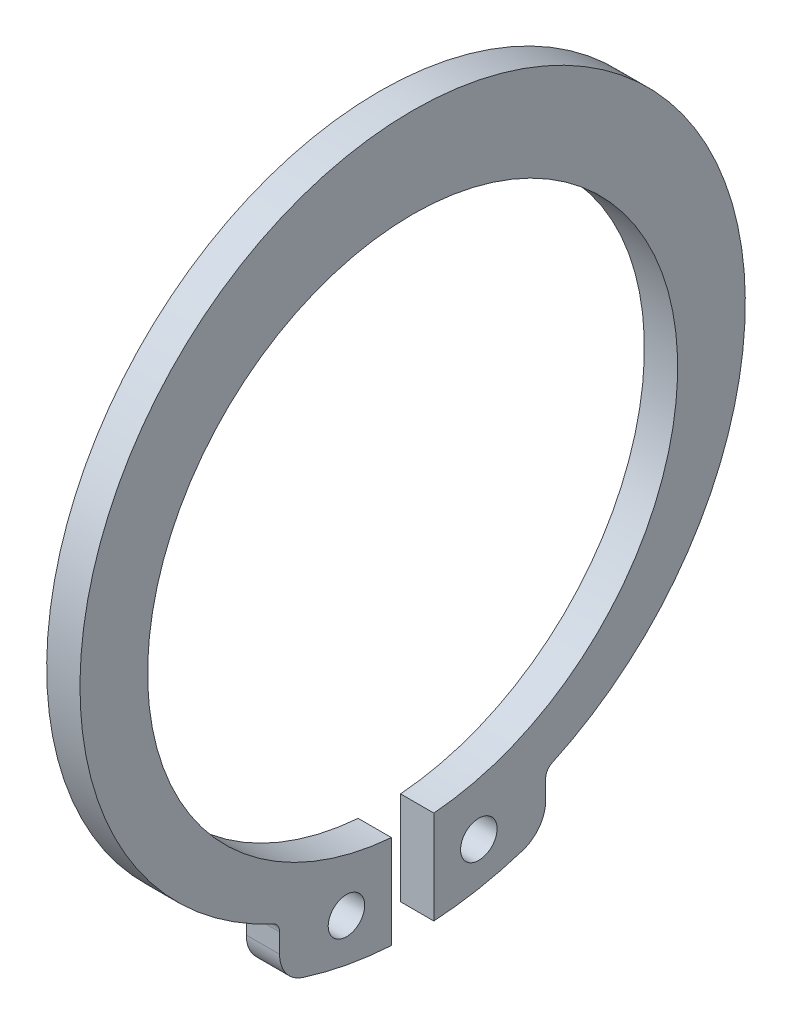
ISO-10303-21;
HEADER;
FILE_DESCRIPTION(('STEP AP214'),'2;1');
FILE_NAME('part.step','',(''),(''),'','','');
FILE_SCHEMA(('AUTOMOTIVE_DESIGN { 1 0 10303 214 1 1 1 1 }'));
ENDSEC;
DATA;
#1=APPLICATION_CONTEXT('core data for automotive mechanical design processes');
#2=APPLICATION_PROTOCOL_DEFINITION('international standard','automotive_design',2000,#1);
#3=PRODUCT_CONTEXT('',#1,'mechanical');
#4=PRODUCT('Part','Part','',(#3));
#5=PRODUCT_RELATED_PRODUCT_CATEGORY('part','',(#4));
#6=PRODUCT_DEFINITION_FORMATION('','',#4);
#7=PRODUCT_DEFINITION_CONTEXT('part definition',#1,'design');
#8=PRODUCT_DEFINITION('design','',#6,#7);
#9=PRODUCT_DEFINITION_SHAPE('','',#8);
#10=(LENGTH_UNIT() NAMED_UNIT(*) SI_UNIT(.MILLI.,.METRE.));
#11=(NAMED_UNIT(*) PLANE_ANGLE_UNIT() SI_UNIT($,.RADIAN.));
#12=(NAMED_UNIT(*) SI_UNIT($,.STERADIAN.) SOLID_ANGLE_UNIT());
#13=UNCERTAINTY_MEASURE_WITH_UNIT(LENGTH_MEASURE(1.E-05),#10,'distance_accuracy_value','');
#14=(GEOMETRIC_REPRESENTATION_CONTEXT(3) GLOBAL_UNCERTAINTY_ASSIGNED_CONTEXT((#13)) GLOBAL_UNIT_ASSIGNED_CONTEXT((#10,
#11,#12)) REPRESENTATION_CONTEXT('',''));
#15=CARTESIAN_POINT('',(0.,0.,0.));
#16=DIRECTION('',(0.,0.,1.));
#17=DIRECTION('',(1.,0.,0.));
#18=AXIS2_PLACEMENT_3D('',#15,#16,#17);
#19=CARTESIAN_POINT('',(1.5,-13.9475272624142,-4.49999999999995));
#20=DIRECTION('',(-1.,0.,0.));
#21=DIRECTION('',(0.,0.,1.));
#22=AXIS2_PLACEMENT_3D('',#19,#20,#21);
#23=PLANE('',#22);
#24=CARTESIAN_POINT('',(1.5,-13.9475272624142,-2.9838971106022));
#25=DIRECTION('',(1.,0.,0.));
#26=DIRECTION('',(0.,0.,-1.));
#27=AXIS2_PLACEMENT_3D('',#24,#25,#26);
#28=CIRCLE('',#27,0.823144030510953);
#29=CARTESIAN_POINT('',(1.5,-13.9475272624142,-3.80704114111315));
#30=VERTEX_POINT('',#29);
#31=EDGE_CURVE('E137',#30,#30,#28,.T.);
#32=ORIENTED_EDGE('',*,*,#31,.F.);
#33=EDGE_LOOP('',(#32));
#34=FACE_BOUND('',#33,.T.);
#35=CARTESIAN_POINT('',(1.5,-13.9475272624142,-4.49999999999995));
#36=DIRECTION('',(1.,0.,0.));
#37=DIRECTION('',(0.,0.,1.));
#38=AXIS2_PLACEMENT_3D('',#35,#36,#37);
#39=CIRCLE('',#38,1.5);
#40=CARTESIAN_POINT('',(1.5,-15.3750663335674,-4.96057811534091));
#41=VERTEX_POINT('',#40);
#42=CARTESIAN_POINT('',(1.5,-13.9475272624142,-5.99999999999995));
#43=VERTEX_POINT('',#42);
#44=EDGE_CURVE('E163',#41,#43,#39,.T.);
#45=ORIENTED_EDGE('',*,*,#44,.T.);
#46=DIRECTION('',(0.,1.,0.));
#47=VECTOR('',#46,1.);
#48=CARTESIAN_POINT('',(1.5,-13.0712472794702,-5.99999999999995));
#49=LINE('',#48,#47);
#50=CARTESIAN_POINT('',(1.5,-13.0712472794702,-5.99999999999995));
#51=VERTEX_POINT('',#50);
#52=EDGE_CURVE('E132',#43,#51,#49,.T.);
#53=ORIENTED_EDGE('',*,*,#52,.T.);
#54=CARTESIAN_POINT('',(1.5,-13.0712472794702,-6.49999999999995));
#55=DIRECTION('',(-1.,0.,0.));
#56=DIRECTION('',(0.,0.,1.));
#57=AXIS2_PLACEMENT_3D('',#54,#55,#56);
#58=CIRCLE('',#57,0.499999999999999);
#59=CARTESIAN_POINT('',(1.5,-12.6173360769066,-6.29032258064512));
#60=VERTEX_POINT('',#59);
#61=EDGE_CURVE('E166',#51,#60,#58,.T.);
#62=ORIENTED_EDGE('',*,*,#61,.T.);
#63=CARTESIAN_POINT('',(1.5,0.999999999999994,0.));
#64=DIRECTION('',(1.,0.,0.));
#65=DIRECTION('',(0.,0.,-1.));
#66=AXIS2_PLACEMENT_3D('',#63,#64,#65);
#67=CIRCLE('',#66,14.9999999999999);
#68=CARTESIAN_POINT('',(1.5,-12.6173360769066,6.29032258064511));
#69=VERTEX_POINT('',#68);
#70=EDGE_CURVE('E168',#60,#69,#67,.T.);
#71=ORIENTED_EDGE('',*,*,#70,.T.);
#72=CARTESIAN_POINT('',(1.5,-13.0712472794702,6.49999999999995));
#73=DIRECTION('',(-1.,0.,0.));
#74=DIRECTION('',(0.,0.,-1.));
#75=AXIS2_PLACEMENT_3D('',#72,#73,#74);
#76=CIRCLE('',#75,0.499999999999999);
#77=CARTESIAN_POINT('',(1.5,-13.0712472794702,5.99999999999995));
#78=VERTEX_POINT('',#77);
#79=EDGE_CURVE('E170',#69,#78,#76,.T.);
#80=ORIENTED_EDGE('',*,*,#79,.T.);
#81=DIRECTION('',(0.,-1.,0.));
#82=VECTOR('',#81,1.);
#83=CARTESIAN_POINT('',(1.5,-13.0712472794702,5.99999999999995));
#84=LINE('',#83,#82);
#85=CARTESIAN_POINT('',(1.5,-13.9475272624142,5.99999999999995));
#86=VERTEX_POINT('',#85);
#87=EDGE_CURVE('E172',#78,#86,#84,.T.);
#88=ORIENTED_EDGE('',*,*,#87,.T.);
#89=CARTESIAN_POINT('',(1.5,-13.9475272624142,4.49999999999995));
#90=DIRECTION('',(1.,0.,0.));
#91=DIRECTION('',(0.,0.,-1.));
#92=AXIS2_PLACEMENT_3D('',#89,#90,#91);
#93=CIRCLE('',#92,1.5);
#94=CARTESIAN_POINT('',(1.5,-15.3750663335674,4.96057811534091));
#95=VERTEX_POINT('',#94);
#96=EDGE_CURVE('E174',#86,#95,#93,.T.);
#97=ORIENTED_EDGE('',*,*,#96,.T.);
#98=CARTESIAN_POINT('',(1.5,0.,0.));
#99=DIRECTION('',(1.,0.,0.));
#100=DIRECTION('',(0.,0.,1.));
#101=AXIS2_PLACEMENT_3D('',#98,#99,#100);
#102=CIRCLE('',#101,16.1554944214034);
#103=CARTESIAN_POINT('',(1.5,-16.1271840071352,0.955999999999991));
#104=VERTEX_POINT('',#103);
#105=EDGE_CURVE('E176',#95,#104,#102,.T.);
#106=ORIENTED_EDGE('',*,*,#105,.T.);
#107=DIRECTION('',(0.,1.,0.));
#108=VECTOR('',#107,1.);
#109=CARTESIAN_POINT('',(1.5,-11.9116986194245,0.955999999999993));
#110=LINE('',#109,#108);
#111=CARTESIAN_POINT('',(1.5,-11.9116986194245,0.955999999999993));
#112=VERTEX_POINT('',#111);
#113=EDGE_CURVE('E178',#104,#112,#110,.T.);
#114=ORIENTED_EDGE('',*,*,#113,.T.);
#115=CARTESIAN_POINT('',(1.5,0.,0.));
#116=DIRECTION('',(-1.,0.,0.));
#117=DIRECTION('',(0.,0.,-1.));
#118=AXIS2_PLACEMENT_3D('',#115,#116,#117);
#119=CIRCLE('',#118,11.95);
#120=CARTESIAN_POINT('',(1.5,-11.9116986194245,-0.955999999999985));
#121=VERTEX_POINT('',#120);
#122=EDGE_CURVE('E180',#112,#121,#119,.T.);
#123=ORIENTED_EDGE('',*,*,#122,.T.);
#124=DIRECTION('',(0.,-1.,0.));
#125=VECTOR('',#124,1.);
#126=CARTESIAN_POINT('',(1.5,-11.9116986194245,-0.955999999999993));
#127=LINE('',#126,#125);
#128=CARTESIAN_POINT('',(1.5,-16.1271840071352,-0.955999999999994));
#129=VERTEX_POINT('',#128);
#130=EDGE_CURVE('E49',#121,#129,#127,.T.);
#131=ORIENTED_EDGE('',*,*,#130,.T.);
#132=CARTESIAN_POINT('',(1.5,0.,0.));
#133=DIRECTION('',(1.,0.,0.));
#134=DIRECTION('',(0.,0.,-1.));
#135=AXIS2_PLACEMENT_3D('',#132,#133,#134);
#136=CIRCLE('',#135,16.1554944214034);
#137=EDGE_CURVE('E44',#129,#41,#136,.T.);
#138=ORIENTED_EDGE('',*,*,#137,.T.);
#139=EDGE_LOOP('',(#45,#53,#62,#71,#80,#88,#97,#106,#114,#123,#131,#138));
#140=FACE_BOUND('',#139,.T.);
#141=CARTESIAN_POINT('',(1.5,-13.9475272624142,2.9838971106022));
#142=DIRECTION('',(1.,0.,0.));
#143=DIRECTION('',(0.,0.,1.));
#144=AXIS2_PLACEMENT_3D('',#141,#142,#143);
#145=CIRCLE('',#144,0.823144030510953);
#146=CARTESIAN_POINT('',(1.5,-13.9475272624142,3.80704114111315));
#147=VERTEX_POINT('',#146);
#148=EDGE_CURVE('E283',#147,#147,#145,.T.);
#149=ORIENTED_EDGE('',*,*,#148,.F.);
#150=EDGE_LOOP('',(#149));
#151=FACE_BOUND('',#150,.T.);
#152=ADVANCED_FACE('F29',(#34,#140,#151),#23,.F.);
#153=CARTESIAN_POINT('',(0.,-13.9475272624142,-4.49999999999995));
#154=DIRECTION('',(-1.,0.,0.));
#155=DIRECTION('',(0.,0.,1.));
#156=AXIS2_PLACEMENT_3D('',#153,#154,#155);
#157=PLANE('',#156);
#158=CARTESIAN_POINT('',(0.,-13.9475272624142,-2.9838971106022));
#159=DIRECTION('',(1.,0.,0.));
#160=DIRECTION('',(0.,0.,-1.));
#161=AXIS2_PLACEMENT_3D('',#158,#159,#160);
#162=CIRCLE('',#161,0.823144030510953);
#163=CARTESIAN_POINT('',(0.,-13.9475272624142,-3.80704114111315));
#164=VERTEX_POINT('',#163);
#165=EDGE_CURVE('E140',#164,#164,#162,.T.);
#166=ORIENTED_EDGE('',*,*,#165,.T.);
#167=EDGE_LOOP('',(#166));
#168=FACE_BOUND('',#167,.T.);
#169=CARTESIAN_POINT('',(0.,-13.9475272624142,-4.49999999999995));
#170=DIRECTION('',(1.,0.,0.));
#171=DIRECTION('',(0.,0.,1.));
#172=AXIS2_PLACEMENT_3D('',#169,#170,#171);
#173=CIRCLE('',#172,1.5);
#174=CARTESIAN_POINT('',(0.,-15.3750663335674,-4.96057811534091));
#175=VERTEX_POINT('',#174);
#176=CARTESIAN_POINT('',(0.,-13.9475272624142,-5.99999999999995));
#177=VERTEX_POINT('',#176);
#178=EDGE_CURVE('E123',#175,#177,#173,.T.);
#179=ORIENTED_EDGE('',*,*,#178,.F.);
#180=CARTESIAN_POINT('',(0.,0.,0.));
#181=DIRECTION('',(1.,0.,0.));
#182=DIRECTION('',(0.,0.,-1.));
#183=AXIS2_PLACEMENT_3D('',#180,#181,#182);
#184=CIRCLE('',#183,16.1554944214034);
#185=CARTESIAN_POINT('',(0.,-16.1271840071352,-0.955999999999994));
#186=VERTEX_POINT('',#185);
#187=EDGE_CURVE('E161',#186,#175,#184,.T.);
#188=ORIENTED_EDGE('',*,*,#187,.F.);
#189=DIRECTION('',(0.,-1.,0.));
#190=VECTOR('',#189,1.);
#191=CARTESIAN_POINT('',(0.,-11.9116986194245,-0.955999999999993));
#192=LINE('',#191,#190);
#193=CARTESIAN_POINT('',(0.,-11.9116986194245,-0.955999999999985));
#194=VERTEX_POINT('',#193);
#195=EDGE_CURVE('E159',#194,#186,#192,.T.);
#196=ORIENTED_EDGE('',*,*,#195,.F.);
#197=CARTESIAN_POINT('',(0.,0.,0.));
#198=DIRECTION('',(-1.,0.,0.));
#199=DIRECTION('',(0.,0.,-1.));
#200=AXIS2_PLACEMENT_3D('',#197,#198,#199);
#201=CIRCLE('',#200,11.95);
#202=CARTESIAN_POINT('',(0.,-11.9116986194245,0.955999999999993));
#203=VERTEX_POINT('',#202);
#204=EDGE_CURVE('E157',#203,#194,#201,.T.);
#205=ORIENTED_EDGE('',*,*,#204,.F.);
#206=DIRECTION('',(0.,1.,0.));
#207=VECTOR('',#206,1.);
#208=CARTESIAN_POINT('',(0.,-11.9116986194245,0.955999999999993));
#209=LINE('',#208,#207);
#210=CARTESIAN_POINT('',(0.,-16.1271840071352,0.955999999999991));
#211=VERTEX_POINT('',#210);
#212=EDGE_CURVE('E155',#211,#203,#209,.T.);
#213=ORIENTED_EDGE('',*,*,#212,.F.);
#214=CARTESIAN_POINT('',(0.,0.,0.));
#215=DIRECTION('',(1.,0.,0.));
#216=DIRECTION('',(0.,0.,1.));
#217=AXIS2_PLACEMENT_3D('',#214,#215,#216);
#218=CIRCLE('',#217,16.1554944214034);
#219=CARTESIAN_POINT('',(0.,-15.3750663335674,4.96057811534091));
#220=VERTEX_POINT('',#219);
#221=EDGE_CURVE('E153',#220,#211,#218,.T.);
#222=ORIENTED_EDGE('',*,*,#221,.F.);
#223=CARTESIAN_POINT('',(0.,-13.9475272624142,4.49999999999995));
#224=DIRECTION('',(1.,0.,0.));
#225=DIRECTION('',(0.,0.,-1.));
#226=AXIS2_PLACEMENT_3D('',#223,#224,#225);
#227=CIRCLE('',#226,1.5);
#228=CARTESIAN_POINT('',(0.,-13.9475272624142,5.99999999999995));
#229=VERTEX_POINT('',#228);
#230=EDGE_CURVE('E151',#229,#220,#227,.T.);
#231=ORIENTED_EDGE('',*,*,#230,.F.);
#232=DIRECTION('',(0.,-1.,0.));
#233=VECTOR('',#232,1.);
#234=CARTESIAN_POINT('',(0.,-13.0712472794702,5.99999999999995));
#235=LINE('',#234,#233);
#236=CARTESIAN_POINT('',(0.,-13.0712472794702,5.99999999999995));
#237=VERTEX_POINT('',#236);
#238=EDGE_CURVE('E149',#237,#229,#235,.T.);
#239=ORIENTED_EDGE('',*,*,#238,.F.);
#240=CARTESIAN_POINT('',(0.,-13.0712472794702,6.49999999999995));
#241=DIRECTION('',(-1.,0.,0.));
#242=DIRECTION('',(0.,0.,-1.));
#243=AXIS2_PLACEMENT_3D('',#240,#241,#242);
#244=CIRCLE('',#243,0.499999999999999);
#245=CARTESIAN_POINT('',(0.,-12.6173360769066,6.29032258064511));
#246=VERTEX_POINT('',#245);
#247=EDGE_CURVE('E147',#246,#237,#244,.T.);
#248=ORIENTED_EDGE('',*,*,#247,.F.);
#249=CARTESIAN_POINT('',(0.,0.999999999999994,0.));
#250=DIRECTION('',(1.,0.,0.));
#251=DIRECTION('',(0.,0.,-1.));
#252=AXIS2_PLACEMENT_3D('',#249,#250,#251);
#253=CIRCLE('',#252,14.9999999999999);
#254=CARTESIAN_POINT('',(0.,-12.6173360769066,-6.29032258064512));
#255=VERTEX_POINT('',#254);
#256=EDGE_CURVE('E145',#255,#246,#253,.T.);
#257=ORIENTED_EDGE('',*,*,#256,.F.);
#258=CARTESIAN_POINT('',(0.,-13.0712472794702,-6.49999999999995));
#259=DIRECTION('',(-1.,0.,0.));
#260=DIRECTION('',(0.,0.,1.));
#261=AXIS2_PLACEMENT_3D('',#258,#259,#260);
#262=CIRCLE('',#261,0.499999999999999);
#263=CARTESIAN_POINT('',(0.,-13.0712472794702,-5.99999999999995));
#264=VERTEX_POINT('',#263);
#265=EDGE_CURVE('E125',#264,#255,#262,.T.);
#266=ORIENTED_EDGE('',*,*,#265,.F.);
#267=DIRECTION('',(0.,1.,0.));
#268=VECTOR('',#267,1.);
#269=CARTESIAN_POINT('',(0.,-13.0712472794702,-5.99999999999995));
#270=LINE('',#269,#268);
#271=EDGE_CURVE('E118',#177,#264,#270,.T.);
#272=ORIENTED_EDGE('',*,*,#271,.F.);
#273=EDGE_LOOP('',(#179,#188,#196,#205,#213,#222,#231,#239,#248,#257,#266,#272));
#274=FACE_BOUND('',#273,.T.);
#275=CARTESIAN_POINT('',(0.,-13.9475272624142,2.9838971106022));
#276=DIRECTION('',(1.,0.,0.));
#277=DIRECTION('',(0.,0.,1.));
#278=AXIS2_PLACEMENT_3D('',#275,#276,#277);
#279=CIRCLE('',#278,0.823144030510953);
#280=CARTESIAN_POINT('',(0.,-13.9475272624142,3.80704114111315));
#281=VERTEX_POINT('',#280);
#282=EDGE_CURVE('E286',#281,#281,#279,.T.);
#283=ORIENTED_EDGE('',*,*,#282,.T.);
#284=EDGE_LOOP('',(#283));
#285=FACE_BOUND('',#284,.T.);
#286=ADVANCED_FACE('F119',(#168,#274,#285),#157,.T.);
#287=CARTESIAN_POINT('',(1.5,-13.9475272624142,-4.49999999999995));
#288=DIRECTION('',(-1.,0.,0.));
#289=DIRECTION('',(0.,0.,1.));
#290=AXIS2_PLACEMENT_3D('',#287,#288,#289);
#291=CYLINDRICAL_SURFACE('',#290,1.5);
#292=ORIENTED_EDGE('',*,*,#178,.T.);
#293=DIRECTION('',(-1.,0.,0.));
#294=VECTOR('',#293,1.);
#295=CARTESIAN_POINT('',(1.5,-13.9475272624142,-5.99999999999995));
#296=LINE('',#295,#294);
#297=EDGE_CURVE('E11',#43,#177,#296,.T.);
#298=ORIENTED_EDGE('',*,*,#297,.F.);
#299=ORIENTED_EDGE('',*,*,#44,.F.);
#300=DIRECTION('',(-1.,0.,0.));
#301=VECTOR('',#300,1.);
#302=CARTESIAN_POINT('',(1.5,-15.3750663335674,-4.96057811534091));
#303=LINE('',#302,#301);
#304=EDGE_CURVE('E136',#41,#175,#303,.T.);
#305=ORIENTED_EDGE('',*,*,#304,.T.);
#306=EDGE_LOOP('',(#292,#298,#299,#305));
#307=FACE_BOUND('',#306,.T.);
#308=ADVANCED_FACE('F31',(#307),#291,.T.);
#309=CARTESIAN_POINT('',(1.5,-13.0712472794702,-5.99999999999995));
#310=DIRECTION('',(0.,0.,1.));
#311=DIRECTION('',(1.,0.,0.));
#312=AXIS2_PLACEMENT_3D('',#309,#310,#311);
#313=PLANE('',#312);
#314=ORIENTED_EDGE('',*,*,#271,.T.);
#315=DIRECTION('',(-1.,0.,0.));
#316=VECTOR('',#315,1.);
#317=CARTESIAN_POINT('',(1.5,-13.0712472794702,-5.99999999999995));
#318=LINE('',#317,#316);
#319=EDGE_CURVE('E37',#51,#264,#318,.T.);
#320=ORIENTED_EDGE('',*,*,#319,.F.);
#321=ORIENTED_EDGE('',*,*,#52,.F.);
#322=ORIENTED_EDGE('',*,*,#297,.T.);
#323=EDGE_LOOP('',(#314,#320,#321,#322));
#324=FACE_BOUND('',#323,.T.);
#325=ADVANCED_FACE('F131',(#324),#313,.F.);
#326=CARTESIAN_POINT('',(1.5,-13.0712472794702,-6.49999999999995));
#327=DIRECTION('',(-1.,0.,0.));
#328=DIRECTION('',(0.,0.,1.));
#329=AXIS2_PLACEMENT_3D('',#326,#327,#328);
#330=CYLINDRICAL_SURFACE('',#329,0.499999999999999);
#331=ORIENTED_EDGE('',*,*,#265,.T.);
#332=DIRECTION('',(-1.,0.,0.));
#333=VECTOR('',#332,1.);
#334=CARTESIAN_POINT('',(1.5,-12.6173360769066,-6.29032258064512));
#335=LINE('',#334,#333);
#336=EDGE_CURVE('E209',#60,#255,#335,.T.);
#337=ORIENTED_EDGE('',*,*,#336,.F.);
#338=ORIENTED_EDGE('',*,*,#61,.F.);
#339=ORIENTED_EDGE('',*,*,#319,.T.);
#340=EDGE_LOOP('',(#331,#337,#338,#339));
#341=FACE_BOUND('',#340,.T.);
#342=ADVANCED_FACE('F213',(#341),#330,.F.);
#343=CARTESIAN_POINT('',(1.5,0.999999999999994,0.));
#344=DIRECTION('',(-1.,0.,0.));
#345=DIRECTION('',(0.,0.,1.));
#346=AXIS2_PLACEMENT_3D('',#343,#344,#345);
#347=CYLINDRICAL_SURFACE('',#346,14.9999999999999);
#348=ORIENTED_EDGE('',*,*,#256,.T.);
#349=DIRECTION('',(-1.,0.,0.));
#350=VECTOR('',#349,1.);
#351=CARTESIAN_POINT('',(1.5,-12.6173360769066,6.29032258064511));
#352=LINE('',#351,#350);
#353=EDGE_CURVE('E206',#69,#246,#352,.T.);
#354=ORIENTED_EDGE('',*,*,#353,.F.);
#355=ORIENTED_EDGE('',*,*,#70,.F.);
#356=ORIENTED_EDGE('',*,*,#336,.T.);
#357=EDGE_LOOP('',(#348,#354,#355,#356));
#358=FACE_BOUND('',#357,.T.);
#359=ADVANCED_FACE('F221',(#358),#347,.T.);
#360=CARTESIAN_POINT('',(1.5,-13.0712472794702,6.49999999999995));
#361=DIRECTION('',(-1.,0.,0.));
#362=DIRECTION('',(0.,0.,1.));
#363=AXIS2_PLACEMENT_3D('',#360,#361,#362);
#364=CYLINDRICAL_SURFACE('',#363,0.499999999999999);
#365=ORIENTED_EDGE('',*,*,#247,.T.);
#366=DIRECTION('',(-1.,0.,0.));
#367=VECTOR('',#366,1.);
#368=CARTESIAN_POINT('',(1.5,-13.0712472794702,5.99999999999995));
#369=LINE('',#368,#367);
#370=EDGE_CURVE('E203',#78,#237,#369,.T.);
#371=ORIENTED_EDGE('',*,*,#370,.F.);
#372=ORIENTED_EDGE('',*,*,#79,.F.);
#373=ORIENTED_EDGE('',*,*,#353,.T.);
#374=EDGE_LOOP('',(#365,#371,#372,#373));
#375=FACE_BOUND('',#374,.T.);
#376=ADVANCED_FACE('F224',(#375),#364,.F.);
#377=CARTESIAN_POINT('',(1.5,-13.0712472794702,5.99999999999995));
#378=DIRECTION('',(0.,0.,-1.));
#379=DIRECTION('',(-1.,0.,0.));
#380=AXIS2_PLACEMENT_3D('',#377,#378,#379);
#381=PLANE('',#380);
#382=ORIENTED_EDGE('',*,*,#238,.T.);
#383=DIRECTION('',(-1.,0.,0.));
#384=VECTOR('',#383,1.);
#385=CARTESIAN_POINT('',(1.5,-13.9475272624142,5.99999999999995));
#386=LINE('',#385,#384);
#387=EDGE_CURVE('E200',#86,#229,#386,.T.);
#388=ORIENTED_EDGE('',*,*,#387,.F.);
#389=ORIENTED_EDGE('',*,*,#87,.F.);
#390=ORIENTED_EDGE('',*,*,#370,.T.);
#391=EDGE_LOOP('',(#382,#388,#389,#390));
#392=FACE_BOUND('',#391,.T.);
#393=ADVANCED_FACE('F229',(#392),#381,.F.);
#394=CARTESIAN_POINT('',(1.5,-13.9475272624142,4.49999999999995));
#395=DIRECTION('',(-1.,0.,0.));
#396=DIRECTION('',(0.,0.,1.));
#397=AXIS2_PLACEMENT_3D('',#394,#395,#396);
#398=CYLINDRICAL_SURFACE('',#397,1.5);
#399=ORIENTED_EDGE('',*,*,#230,.T.);
#400=DIRECTION('',(-1.,0.,0.));
#401=VECTOR('',#400,1.);
#402=CARTESIAN_POINT('',(1.5,-15.3750663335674,4.96057811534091));
#403=LINE('',#402,#401);
#404=EDGE_CURVE('E197',#95,#220,#403,.T.);
#405=ORIENTED_EDGE('',*,*,#404,.F.);
#406=ORIENTED_EDGE('',*,*,#96,.F.);
#407=ORIENTED_EDGE('',*,*,#387,.T.);
#408=EDGE_LOOP('',(#399,#405,#406,#407));
#409=FACE_BOUND('',#408,.T.);
#410=ADVANCED_FACE('F235',(#409),#398,.T.);
#411=CARTESIAN_POINT('',(1.5,0.,0.));
#412=DIRECTION('',(-1.,0.,0.));
#413=DIRECTION('',(0.,0.,1.));
#414=AXIS2_PLACEMENT_3D('',#411,#412,#413);
#415=CYLINDRICAL_SURFACE('',#414,16.1554944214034);
#416=ORIENTED_EDGE('',*,*,#221,.T.);
#417=DIRECTION('',(-1.,0.,0.));
#418=VECTOR('',#417,1.);
#419=CARTESIAN_POINT('',(1.5,-16.1271840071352,0.955999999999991));
#420=LINE('',#419,#418);
#421=EDGE_CURVE('E194',#104,#211,#420,.T.);
#422=ORIENTED_EDGE('',*,*,#421,.F.);
#423=ORIENTED_EDGE('',*,*,#105,.F.);
#424=ORIENTED_EDGE('',*,*,#404,.T.);
#425=EDGE_LOOP('',(#416,#422,#423,#424));
#426=FACE_BOUND('',#425,.T.);
#427=ADVANCED_FACE('F239',(#426),#415,.T.);
#428=CARTESIAN_POINT('',(1.5,-11.9116986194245,0.955999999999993));
#429=DIRECTION('',(0.,0.,1.));
#430=DIRECTION('',(0.,-1.,0.));
#431=AXIS2_PLACEMENT_3D('',#428,#429,#430);
#432=PLANE('',#431);
#433=ORIENTED_EDGE('',*,*,#212,.T.);
#434=DIRECTION('',(-1.,0.,0.));
#435=VECTOR('',#434,1.);
#436=CARTESIAN_POINT('',(1.5,-11.9116986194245,0.955999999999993));
#437=LINE('',#436,#435);
#438=EDGE_CURVE('E191',#112,#203,#437,.T.);
#439=ORIENTED_EDGE('',*,*,#438,.F.);
#440=ORIENTED_EDGE('',*,*,#113,.F.);
#441=ORIENTED_EDGE('',*,*,#421,.T.);
#442=EDGE_LOOP('',(#433,#439,#440,#441));
#443=FACE_BOUND('',#442,.T.);
#444=ADVANCED_FACE('F244',(#443),#432,.F.);
#445=CARTESIAN_POINT('',(1.5,0.,0.));
#446=DIRECTION('',(-1.,0.,0.));
#447=DIRECTION('',(0.,0.,1.));
#448=AXIS2_PLACEMENT_3D('',#445,#446,#447);
#449=CYLINDRICAL_SURFACE('',#448,11.95);
#450=ORIENTED_EDGE('',*,*,#204,.T.);
#451=DIRECTION('',(-1.,0.,0.));
#452=VECTOR('',#451,1.);
#453=CARTESIAN_POINT('',(1.5,-11.9116986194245,-0.955999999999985));
#454=LINE('',#453,#452);
#455=EDGE_CURVE('E188',#121,#194,#454,.T.);
#456=ORIENTED_EDGE('',*,*,#455,.F.);
#457=ORIENTED_EDGE('',*,*,#122,.F.);
#458=ORIENTED_EDGE('',*,*,#438,.T.);
#459=EDGE_LOOP('',(#450,#456,#457,#458));
#460=FACE_BOUND('',#459,.T.);
#461=ADVANCED_FACE('F248',(#460),#449,.F.);
#462=CARTESIAN_POINT('',(1.5,-11.9116986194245,-0.955999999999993));
#463=DIRECTION('',(0.,0.,-1.));
#464=DIRECTION('',(0.,1.,0.));
#465=AXIS2_PLACEMENT_3D('',#462,#463,#464);
#466=PLANE('',#465);
#467=ORIENTED_EDGE('',*,*,#195,.T.);
#468=DIRECTION('',(-1.,0.,0.));
#469=VECTOR('',#468,1.);
#470=CARTESIAN_POINT('',(1.5,-16.1271840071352,-0.955999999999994));
#471=LINE('',#470,#469);
#472=EDGE_CURVE('E185',#129,#186,#471,.T.);
#473=ORIENTED_EDGE('',*,*,#472,.F.);
#474=ORIENTED_EDGE('',*,*,#130,.F.);
#475=ORIENTED_EDGE('',*,*,#455,.T.);
#476=EDGE_LOOP('',(#467,#473,#474,#475));
#477=FACE_BOUND('',#476,.T.);
#478=ADVANCED_FACE('F252',(#477),#466,.F.);
#479=CARTESIAN_POINT('',(1.5,0.,0.));
#480=DIRECTION('',(-1.,0.,0.));
#481=DIRECTION('',(0.,0.,1.));
#482=AXIS2_PLACEMENT_3D('',#479,#480,#481);
#483=CYLINDRICAL_SURFACE('',#482,16.1554944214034);
#484=ORIENTED_EDGE('',*,*,#187,.T.);
#485=ORIENTED_EDGE('',*,*,#304,.F.);
#486=ORIENTED_EDGE('',*,*,#137,.F.);
#487=ORIENTED_EDGE('',*,*,#472,.T.);
#488=EDGE_LOOP('',(#484,#485,#486,#487));
#489=FACE_BOUND('',#488,.T.);
#490=ADVANCED_FACE('F254',(#489),#483,.T.);
#491=CARTESIAN_POINT('',(1.5,-13.9475272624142,-2.9838971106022));
#492=DIRECTION('',(-1.,0.,0.));
#493=DIRECTION('',(0.,0.,1.));
#494=AXIS2_PLACEMENT_3D('',#491,#492,#493);
#495=CYLINDRICAL_SURFACE('',#494,0.823144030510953);
#496=ORIENTED_EDGE('',*,*,#31,.T.);
#497=EDGE_LOOP('',(#496));
#498=FACE_BOUND('',#497,.T.);
#499=ORIENTED_EDGE('',*,*,#165,.F.);
#500=EDGE_LOOP('',(#499));
#501=FACE_BOUND('',#500,.T.);
#502=ADVANCED_FACE('F256',(#498,#501),#495,.F.);
#503=CARTESIAN_POINT('',(1.5,-13.9475272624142,2.9838971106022));
#504=DIRECTION('',(-1.,0.,0.));
#505=DIRECTION('',(0.,0.,1.));
#506=AXIS2_PLACEMENT_3D('',#503,#504,#505);
#507=CYLINDRICAL_SURFACE('',#506,0.823144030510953);
#508=ORIENTED_EDGE('',*,*,#148,.T.);
#509=EDGE_LOOP('',(#508));
#510=FACE_BOUND('',#509,.T.);
#511=ORIENTED_EDGE('',*,*,#282,.F.);
#512=EDGE_LOOP('',(#511));
#513=FACE_BOUND('',#512,.T.);
#514=ADVANCED_FACE('F262',(#510,#513),#507,.F.);
#515=CLOSED_SHELL('',(#152,#286,#308,#325,#342,#359,#376,#393,#410,#427,#444,#461,#478,#490,
#502,#514));
#516=MANIFOLD_SOLID_BREP('B2',#515);
#517=ADVANCED_BREP_SHAPE_REPRESENTATION('',(#18,#516),#14);
#518=SHAPE_DEFINITION_REPRESENTATION(#9,#517);
ENDSEC;
END-ISO-10303-21;
